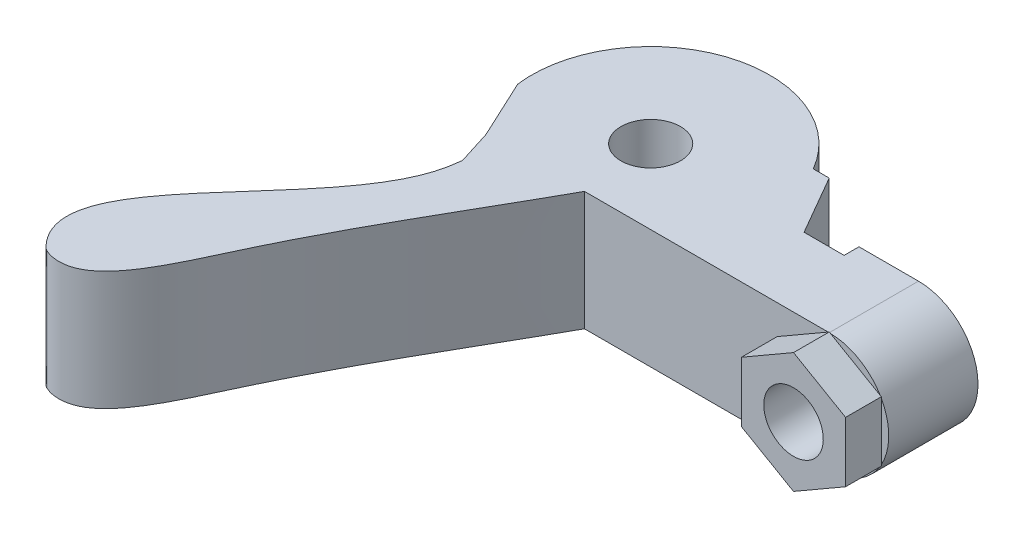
ISO-10303-21;
HEADER;
FILE_DESCRIPTION(('STEP AP214'),'2;1');
FILE_NAME('part.step','',(''),(''),'','','');
FILE_SCHEMA(('AUTOMOTIVE_DESIGN { 1 0 10303 214 1 1 1 1 }'));
ENDSEC;
DATA;
#1=APPLICATION_CONTEXT('core data for automotive mechanical design processes');
#2=APPLICATION_PROTOCOL_DEFINITION('international standard','automotive_design',2000,#1);
#3=PRODUCT_CONTEXT('',#1,'mechanical');
#4=PRODUCT('Part','Part','',(#3));
#5=PRODUCT_RELATED_PRODUCT_CATEGORY('part','',(#4));
#6=PRODUCT_DEFINITION_FORMATION('','',#4);
#7=PRODUCT_DEFINITION_CONTEXT('part definition',#1,'design');
#8=PRODUCT_DEFINITION('design','',#6,#7);
#9=PRODUCT_DEFINITION_SHAPE('','',#8);
#10=(LENGTH_UNIT() NAMED_UNIT(*) SI_UNIT(.MILLI.,.METRE.));
#11=(NAMED_UNIT(*) PLANE_ANGLE_UNIT() SI_UNIT($,.RADIAN.));
#12=(NAMED_UNIT(*) SI_UNIT($,.STERADIAN.) SOLID_ANGLE_UNIT());
#13=UNCERTAINTY_MEASURE_WITH_UNIT(LENGTH_MEASURE(1.E-05),#10,'distance_accuracy_value','');
#14=(GEOMETRIC_REPRESENTATION_CONTEXT(3) GLOBAL_UNCERTAINTY_ASSIGNED_CONTEXT((#13)) GLOBAL_UNIT_ASSIGNED_CONTEXT((#10,
#11,#12)) REPRESENTATION_CONTEXT('',''));
#15=CARTESIAN_POINT('',(0.,0.,0.));
#16=DIRECTION('',(0.,0.,1.));
#17=DIRECTION('',(1.,0.,0.));
#18=AXIS2_PLACEMENT_3D('',#15,#16,#17);
#19=CARTESIAN_POINT('',(20.5,-6.06217782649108,5.));
#20=DIRECTION('',(0.,0.,1.));
#21=DIRECTION('',(0.,1.,0.));
#22=AXIS2_PLACEMENT_3D('',#19,#20,#21);
#23=PLANE('',#22);
#24=CARTESIAN_POINT('',(17.,0.,5.));
#25=DIRECTION('',(0.,0.,1.));
#26=DIRECTION('',(1.,0.,0.));
#27=AXIS2_PLACEMENT_3D('',#24,#25,#26);
#28=CIRCLE('',#27,4.);
#29=CARTESIAN_POINT('',(20.5,-1.9364916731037,5.));
#30=VERTEX_POINT('',#29);
#31=CARTESIAN_POINT('',(20.4270509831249,-2.06284307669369,5.));
#32=VERTEX_POINT('',#31);
#33=EDGE_CURVE('E9',#30,#32,#28,.F.);
#34=ORIENTED_EDGE('',*,*,#33,.F.);
#35=DIRECTION('',(0.,1.,0.));
#36=VECTOR('',#35,1.);
#37=CARTESIAN_POINT('',(20.5,-2.02072594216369,5.));
#38=LINE('',#37,#36);
#39=CARTESIAN_POINT('',(20.5,-2.02072594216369,5.));
#40=VERTEX_POINT('',#39);
#41=EDGE_CURVE('E181',#40,#30,#38,.T.);
#42=ORIENTED_EDGE('',*,*,#41,.F.);
#43=DIRECTION('',(0.866025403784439,0.5,0.));
#44=VECTOR('',#43,1.);
#45=CARTESIAN_POINT('',(17.,-4.04145188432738,5.));
#46=LINE('',#45,#44);
#47=EDGE_CURVE('E175',#32,#40,#46,.T.);
#48=ORIENTED_EDGE('',*,*,#47,.F.);
#49=EDGE_LOOP('',(#34,#42,#48));
#50=FACE_BOUND('',#49,.T.);
#51=ADVANCED_FACE('F14',(#50),#23,.F.);
#52=DIRECTION('',(-1.,0.,0.));
#53=VECTOR('',#52,1.);
#54=CARTESIAN_POINT('',(20.5,-4.,5.));
#55=LINE('',#54,#53);
#56=CARTESIAN_POINT('',(17.,-4.,5.));
#57=VERTEX_POINT('',#56);
#58=CARTESIAN_POINT('',(16.9282032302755,-4.,5.));
#59=VERTEX_POINT('',#58);
#60=EDGE_CURVE('E24',#57,#59,#55,.T.);
#61=ORIENTED_EDGE('',*,*,#60,.F.);
#62=CARTESIAN_POINT('',(17.0729490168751,-3.99933474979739,5.));
#63=VERTEX_POINT('',#62);
#64=EDGE_CURVE('E26',#63,#57,#28,.F.);
#65=ORIENTED_EDGE('',*,*,#64,.F.);
#66=CARTESIAN_POINT('',(17.,-4.04145188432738,5.));
#67=VERTEX_POINT('',#66);
#68=EDGE_CURVE('E176',#67,#63,#46,.T.);
#69=ORIENTED_EDGE('',*,*,#68,.F.);
#70=DIRECTION('',(0.866025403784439,-0.5,0.));
#71=VECTOR('',#70,1.);
#72=CARTESIAN_POINT('',(13.5,-2.02072594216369,5.));
#73=LINE('',#72,#71);
#74=EDGE_CURVE('E166',#59,#67,#73,.T.);
#75=ORIENTED_EDGE('',*,*,#74,.F.);
#76=EDGE_LOOP('',(#61,#65,#69,#75));
#77=FACE_BOUND('',#76,.T.);
#78=ADVANCED_FACE('F344',(#77),#23,.F.);
#79=CARTESIAN_POINT('',(20.4270509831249,2.06284307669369,5.));
#80=VERTEX_POINT('',#79);
#81=CARTESIAN_POINT('',(20.5,1.9364916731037,5.));
#82=VERTEX_POINT('',#81);
#83=EDGE_CURVE('E27',#80,#82,#28,.F.);
#84=ORIENTED_EDGE('',*,*,#83,.F.);
#85=DIRECTION('',(-0.866025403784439,0.5,0.));
#86=VECTOR('',#85,1.);
#87=CARTESIAN_POINT('',(20.5,2.02072594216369,5.));
#88=LINE('',#87,#86);
#89=CARTESIAN_POINT('',(20.5,2.02072594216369,5.));
#90=VERTEX_POINT('',#89);
#91=EDGE_CURVE('E186',#90,#80,#88,.T.);
#92=ORIENTED_EDGE('',*,*,#91,.F.);
#93=EDGE_CURVE('E179',#82,#90,#38,.T.);
#94=ORIENTED_EDGE('',*,*,#93,.F.);
#95=EDGE_LOOP('',(#84,#92,#94));
#96=FACE_BOUND('',#95,.T.);
#97=ADVANCED_FACE('F398',(#96),#23,.F.);
#98=CARTESIAN_POINT('',(13.5,-2.02072594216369,7.4));
#99=DIRECTION('',(0.5,0.866025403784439,0.));
#100=DIRECTION('',(-0.866025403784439,0.5,0.));
#101=AXIS2_PLACEMENT_3D('',#98,#99,#100);
#102=PLANE('',#101);
#103=CARTESIAN_POINT('',(13.5,-2.02072594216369,5.));
#104=VERTEX_POINT('',#103);
#105=EDGE_CURVE('E171',#104,#59,#73,.T.);
#106=ORIENTED_EDGE('',*,*,#105,.T.);
#107=ORIENTED_EDGE('',*,*,#74,.T.);
#108=DIRECTION('',(0.,0.,-1.));
#109=VECTOR('',#108,1.);
#110=CARTESIAN_POINT('',(17.,-4.04145188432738,7.4));
#111=LINE('',#110,#109);
#112=CARTESIAN_POINT('',(17.,-4.04145188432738,7.4));
#113=VERTEX_POINT('',#112);
#114=EDGE_CURVE('E230',#113,#67,#111,.T.);
#115=ORIENTED_EDGE('',*,*,#114,.F.);
#116=DIRECTION('',(0.866025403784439,-0.5,0.));
#117=VECTOR('',#116,1.);
#118=CARTESIAN_POINT('',(13.5,-2.02072594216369,7.4));
#119=LINE('',#118,#117);
#120=CARTESIAN_POINT('',(13.5,-2.02072594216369,7.4));
#121=VERTEX_POINT('',#120);
#122=EDGE_CURVE('E197',#121,#113,#119,.T.);
#123=ORIENTED_EDGE('',*,*,#122,.F.);
#124=DIRECTION('',(0.,0.,-1.));
#125=VECTOR('',#124,1.);
#126=CARTESIAN_POINT('',(13.5,-2.02072594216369,7.4));
#127=LINE('',#126,#125);
#128=EDGE_CURVE('E215',#121,#104,#127,.T.);
#129=ORIENTED_EDGE('',*,*,#128,.T.);
#130=EDGE_LOOP('',(#106,#107,#115,#123,#129));
#131=FACE_BOUND('',#130,.T.);
#132=ADVANCED_FACE('F427',(#131),#102,.F.);
#133=CARTESIAN_POINT('',(17.,-4.04145188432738,7.4));
#134=DIRECTION('',(-0.5,0.866025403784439,0.));
#135=DIRECTION('',(-0.866025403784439,-0.5,0.));
#136=AXIS2_PLACEMENT_3D('',#133,#134,#135);
#137=PLANE('',#136);
#138=ORIENTED_EDGE('',*,*,#68,.T.);
#139=EDGE_CURVE('E180',#63,#32,#46,.T.);
#140=ORIENTED_EDGE('',*,*,#139,.T.);
#141=ORIENTED_EDGE('',*,*,#47,.T.);
#142=DIRECTION('',(0.,0.,-1.));
#143=VECTOR('',#142,1.);
#144=CARTESIAN_POINT('',(20.5,-2.02072594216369,7.4));
#145=LINE('',#144,#143);
#146=CARTESIAN_POINT('',(20.5,-2.02072594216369,7.4));
#147=VERTEX_POINT('',#146);
#148=EDGE_CURVE('E227',#147,#40,#145,.T.);
#149=ORIENTED_EDGE('',*,*,#148,.F.);
#150=DIRECTION('',(0.866025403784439,0.5,0.));
#151=VECTOR('',#150,1.);
#152=CARTESIAN_POINT('',(17.,-4.04145188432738,7.4));
#153=LINE('',#152,#151);
#154=EDGE_CURVE('E200',#113,#147,#153,.T.);
#155=ORIENTED_EDGE('',*,*,#154,.F.);
#156=ORIENTED_EDGE('',*,*,#114,.T.);
#157=EDGE_LOOP('',(#138,#140,#141,#149,#155,#156));
#158=FACE_BOUND('',#157,.T.);
#159=ADVANCED_FACE('F341',(#158),#137,.F.);
#160=CARTESIAN_POINT('',(20.5,-2.02072594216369,7.4));
#161=DIRECTION('',(-1.,0.,0.));
#162=DIRECTION('',(0.,-1.,0.));
#163=AXIS2_PLACEMENT_3D('',#160,#161,#162);
#164=PLANE('',#163);
#165=ORIENTED_EDGE('',*,*,#41,.T.);
#166=EDGE_CURVE('E185',#30,#82,#38,.T.);
#167=ORIENTED_EDGE('',*,*,#166,.T.);
#168=ORIENTED_EDGE('',*,*,#93,.T.);
#169=DIRECTION('',(0.,0.,-1.));
#170=VECTOR('',#169,1.);
#171=CARTESIAN_POINT('',(20.5,2.02072594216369,7.4));
#172=LINE('',#171,#170);
#173=CARTESIAN_POINT('',(20.5,2.02072594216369,7.4));
#174=VERTEX_POINT('',#173);
#175=EDGE_CURVE('E224',#174,#90,#172,.T.);
#176=ORIENTED_EDGE('',*,*,#175,.F.);
#177=DIRECTION('',(0.,1.,0.));
#178=VECTOR('',#177,1.);
#179=CARTESIAN_POINT('',(20.5,-2.02072594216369,7.4));
#180=LINE('',#179,#178);
#181=EDGE_CURVE('E203',#147,#174,#180,.T.);
#182=ORIENTED_EDGE('',*,*,#181,.F.);
#183=ORIENTED_EDGE('',*,*,#148,.T.);
#184=EDGE_LOOP('',(#165,#167,#168,#176,#182,#183));
#185=FACE_BOUND('',#184,.T.);
#186=ADVANCED_FACE('F395',(#185),#164,.F.);
#187=CARTESIAN_POINT('',(20.5,2.02072594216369,7.4));
#188=DIRECTION('',(-0.5,-0.866025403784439,0.));
#189=DIRECTION('',(0.866025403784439,-0.5,0.));
#190=AXIS2_PLACEMENT_3D('',#187,#188,#189);
#191=PLANE('',#190);
#192=ORIENTED_EDGE('',*,*,#91,.T.);
#193=CARTESIAN_POINT('',(17.0729490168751,3.99933474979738,5.));
#194=VERTEX_POINT('',#193);
#195=EDGE_CURVE('E190',#80,#194,#88,.T.);
#196=ORIENTED_EDGE('',*,*,#195,.T.);
#197=CARTESIAN_POINT('',(17.,4.04145188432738,5.));
#198=VERTEX_POINT('',#197);
#199=EDGE_CURVE('E184',#194,#198,#88,.T.);
#200=ORIENTED_EDGE('',*,*,#199,.T.);
#201=DIRECTION('',(0.,0.,-1.));
#202=VECTOR('',#201,1.);
#203=CARTESIAN_POINT('',(17.,4.04145188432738,7.4));
#204=LINE('',#203,#202);
#205=CARTESIAN_POINT('',(17.,4.04145188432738,7.4));
#206=VERTEX_POINT('',#205);
#207=EDGE_CURVE('E221',#206,#198,#204,.T.);
#208=ORIENTED_EDGE('',*,*,#207,.F.);
#209=DIRECTION('',(-0.866025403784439,0.5,0.));
#210=VECTOR('',#209,1.);
#211=CARTESIAN_POINT('',(20.5,2.02072594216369,7.4));
#212=LINE('',#211,#210);
#213=EDGE_CURVE('E206',#174,#206,#212,.T.);
#214=ORIENTED_EDGE('',*,*,#213,.F.);
#215=ORIENTED_EDGE('',*,*,#175,.T.);
#216=EDGE_LOOP('',(#192,#196,#200,#208,#214,#215));
#217=FACE_BOUND('',#216,.T.);
#218=ADVANCED_FACE('F400',(#217),#191,.F.);
#219=CARTESIAN_POINT('',(17.,4.04145188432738,7.4));
#220=DIRECTION('',(0.5,-0.866025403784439,0.));
#221=DIRECTION('',(0.866025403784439,0.5,0.));
#222=AXIS2_PLACEMENT_3D('',#219,#220,#221);
#223=PLANE('',#222);
#224=DIRECTION('',(-0.866025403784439,-0.5,0.));
#225=VECTOR('',#224,1.);
#226=CARTESIAN_POINT('',(17.,4.04145188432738,5.));
#227=LINE('',#226,#225);
#228=CARTESIAN_POINT('',(16.9282032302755,4.,5.));
#229=VERTEX_POINT('',#228);
#230=EDGE_CURVE('E191',#198,#229,#227,.T.);
#231=ORIENTED_EDGE('',*,*,#230,.T.);
#232=CARTESIAN_POINT('',(13.5,2.02072594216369,5.));
#233=VERTEX_POINT('',#232);
#234=EDGE_CURVE('E189',#229,#233,#227,.T.);
#235=ORIENTED_EDGE('',*,*,#234,.T.);
#236=DIRECTION('',(0.,0.,-1.));
#237=VECTOR('',#236,1.);
#238=CARTESIAN_POINT('',(13.5,2.02072594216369,7.4));
#239=LINE('',#238,#237);
#240=CARTESIAN_POINT('',(13.5,2.02072594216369,7.4));
#241=VERTEX_POINT('',#240);
#242=EDGE_CURVE('E218',#241,#233,#239,.T.);
#243=ORIENTED_EDGE('',*,*,#242,.F.);
#244=DIRECTION('',(-0.866025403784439,-0.5,0.));
#245=VECTOR('',#244,1.);
#246=CARTESIAN_POINT('',(17.,4.04145188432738,7.4));
#247=LINE('',#246,#245);
#248=EDGE_CURVE('E209',#206,#241,#247,.T.);
#249=ORIENTED_EDGE('',*,*,#248,.F.);
#250=ORIENTED_EDGE('',*,*,#207,.T.);
#251=EDGE_LOOP('',(#231,#235,#243,#249,#250));
#252=FACE_BOUND('',#251,.T.);
#253=ADVANCED_FACE('F526',(#252),#223,.F.);
#254=CARTESIAN_POINT('',(13.5,2.02072594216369,7.4));
#255=DIRECTION('',(1.,0.,0.));
#256=DIRECTION('',(0.,1.,0.));
#257=AXIS2_PLACEMENT_3D('',#254,#255,#256);
#258=PLANE('',#257);
#259=DIRECTION('',(0.,-1.,0.));
#260=VECTOR('',#259,1.);
#261=CARTESIAN_POINT('',(13.5,2.02072594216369,5.));
#262=LINE('',#261,#260);
#263=EDGE_CURVE('E194',#233,#104,#262,.T.);
#264=ORIENTED_EDGE('',*,*,#263,.T.);
#265=ORIENTED_EDGE('',*,*,#128,.F.);
#266=DIRECTION('',(0.,-1.,0.));
#267=VECTOR('',#266,1.);
#268=CARTESIAN_POINT('',(13.5,2.02072594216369,7.4));
#269=LINE('',#268,#267);
#270=EDGE_CURVE('E212',#241,#121,#269,.T.);
#271=ORIENTED_EDGE('',*,*,#270,.F.);
#272=ORIENTED_EDGE('',*,*,#242,.T.);
#273=EDGE_LOOP('',(#264,#265,#271,#272));
#274=FACE_BOUND('',#273,.T.);
#275=ADVANCED_FACE('F531',(#274),#258,.F.);
#276=CARTESIAN_POINT('',(20.5,-6.06217782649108,7.4));
#277=DIRECTION('',(0.,0.,1.));
#278=DIRECTION('',(0.,1.,0.));
#279=AXIS2_PLACEMENT_3D('',#276,#277,#278);
#280=PLANE('',#279);
#281=CARTESIAN_POINT('',(17.,0.,7.4));
#282=DIRECTION('',(0.,0.,1.));
#283=DIRECTION('',(0.,1.,0.));
#284=AXIS2_PLACEMENT_3D('',#281,#282,#283);
#285=CIRCLE('',#284,2.);
#286=CARTESIAN_POINT('',(17.,1.99999999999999,7.4));
#287=VERTEX_POINT('',#286);
#288=EDGE_CURVE('E161',#287,#287,#285,.T.);
#289=ORIENTED_EDGE('',*,*,#288,.F.);
#290=EDGE_LOOP('',(#289));
#291=FACE_BOUND('',#290,.T.);
#292=ORIENTED_EDGE('',*,*,#122,.T.);
#293=ORIENTED_EDGE('',*,*,#154,.T.);
#294=ORIENTED_EDGE('',*,*,#181,.T.);
#295=ORIENTED_EDGE('',*,*,#213,.T.);
#296=ORIENTED_EDGE('',*,*,#248,.T.);
#297=ORIENTED_EDGE('',*,*,#270,.T.);
#298=EDGE_LOOP('',(#292,#293,#294,#295,#296,#297));
#299=FACE_BOUND('',#298,.T.);
#300=ADVANCED_FACE('F406',(#291,#299),#280,.T.);
#301=CARTESIAN_POINT('',(17.,4.,5.));
#302=VERTEX_POINT('',#301);
#303=EDGE_CURVE('E234',#302,#194,#28,.F.);
#304=ORIENTED_EDGE('',*,*,#303,.F.);
#305=DIRECTION('',(-1.,0.,0.));
#306=VECTOR('',#305,1.);
#307=CARTESIAN_POINT('',(20.5,4.,5.));
#308=LINE('',#307,#306);
#309=EDGE_CURVE('E235',#302,#229,#308,.T.);
#310=ORIENTED_EDGE('',*,*,#309,.T.);
#311=ORIENTED_EDGE('',*,*,#230,.F.);
#312=ORIENTED_EDGE('',*,*,#199,.F.);
#313=EDGE_LOOP('',(#304,#310,#311,#312));
#314=FACE_BOUND('',#313,.T.);
#315=ADVANCED_FACE('F411',(#314),#23,.F.);
#316=CARTESIAN_POINT('',(17.,0.,7.4));
#317=DIRECTION('',(0.,0.,1.));
#318=DIRECTION('',(0.,1.,0.));
#319=AXIS2_PLACEMENT_3D('',#316,#317,#318);
#320=CYLINDRICAL_SURFACE('',#319,2.);
#321=ORIENTED_EDGE('',*,*,#288,.T.);
#322=EDGE_LOOP('',(#321));
#323=FACE_BOUND('',#322,.T.);
#324=CARTESIAN_POINT('',(17.,0.,-1.));
#325=DIRECTION('',(0.,0.,1.));
#326=DIRECTION('',(1.,0.,0.));
#327=AXIS2_PLACEMENT_3D('',#324,#325,#326);
#328=CIRCLE('',#327,2.);
#329=CARTESIAN_POINT('',(19.,0.,-1.));
#330=VERTEX_POINT('',#329);
#331=EDGE_CURVE('E18',#330,#330,#328,.T.);
#332=ORIENTED_EDGE('',*,*,#331,.F.);
#333=EDGE_LOOP('',(#332));
#334=FACE_BOUND('',#333,.T.);
#335=ADVANCED_FACE('F293',(#323,#334),#320,.F.);
#336=CARTESIAN_POINT('',(13.,4.,0.));
#337=DIRECTION('',(1.,0.,0.));
#338=DIRECTION('',(0.,1.,0.));
#339=AXIS2_PLACEMENT_3D('',#336,#337,#338);
#340=PLANE('',#339);
#341=DIRECTION('',(0.,0.,1.));
#342=VECTOR('',#341,1.);
#343=CARTESIAN_POINT('',(13.,-4.,0.));
#344=LINE('',#343,#342);
#345=CARTESIAN_POINT('',(13.,-4.,-1.));
#346=VERTEX_POINT('',#345);
#347=CARTESIAN_POINT('',(13.,-4.,0.));
#348=VERTEX_POINT('',#347);
#349=EDGE_CURVE('E498',#346,#348,#344,.T.);
#350=ORIENTED_EDGE('',*,*,#349,.T.);
#351=DIRECTION('',(0.,-1.,0.));
#352=VECTOR('',#351,1.);
#353=CARTESIAN_POINT('',(13.,4.,0.));
#354=LINE('',#353,#352);
#355=CARTESIAN_POINT('',(13.,4.,0.));
#356=VERTEX_POINT('',#355);
#357=EDGE_CURVE('E155',#356,#348,#354,.T.);
#358=ORIENTED_EDGE('',*,*,#357,.F.);
#359=DIRECTION('',(0.,0.,1.));
#360=VECTOR('',#359,1.);
#361=CARTESIAN_POINT('',(13.,4.,0.));
#362=LINE('',#361,#360);
#363=CARTESIAN_POINT('',(13.,4.,-1.));
#364=VERTEX_POINT('',#363);
#365=EDGE_CURVE('E483',#364,#356,#362,.T.);
#366=ORIENTED_EDGE('',*,*,#365,.F.);
#367=DIRECTION('',(0.,-1.,0.));
#368=VECTOR('',#367,1.);
#369=CARTESIAN_POINT('',(13.,4.,-1.));
#370=LINE('',#369,#368);
#371=EDGE_CURVE('E158',#364,#346,#370,.T.);
#372=ORIENTED_EDGE('',*,*,#371,.T.);
#373=EDGE_LOOP('',(#350,#358,#366,#372));
#374=FACE_BOUND('',#373,.T.);
#375=ADVANCED_FACE('F290',(#374),#340,.F.);
#376=CARTESIAN_POINT('',(10.3094010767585,4.,0.));
#377=DIRECTION('',(0.,0.,1.));
#378=DIRECTION('',(1.,0.,0.));
#379=AXIS2_PLACEMENT_3D('',#376,#377,#378);
#380=PLANE('',#379);
#381=DIRECTION('',(-1.,0.,0.));
#382=VECTOR('',#381,1.);
#383=CARTESIAN_POINT('',(10.3094010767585,-4.,0.));
#384=LINE('',#383,#382);
#385=CARTESIAN_POINT('',(10.3094010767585,-4.,0.));
#386=VERTEX_POINT('',#385);
#387=EDGE_CURVE('E500',#348,#386,#384,.T.);
#388=ORIENTED_EDGE('',*,*,#387,.T.);
#389=DIRECTION('',(0.,-1.,0.));
#390=VECTOR('',#389,1.);
#391=CARTESIAN_POINT('',(10.3094010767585,4.,0.));
#392=LINE('',#391,#390);
#393=CARTESIAN_POINT('',(10.3094010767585,4.,0.));
#394=VERTEX_POINT('',#393);
#395=EDGE_CURVE('E152',#394,#386,#392,.T.);
#396=ORIENTED_EDGE('',*,*,#395,.F.);
#397=DIRECTION('',(-1.,0.,0.));
#398=VECTOR('',#397,1.);
#399=CARTESIAN_POINT('',(10.3094010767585,4.,0.));
#400=LINE('',#399,#398);
#401=EDGE_CURVE('E485',#356,#394,#400,.T.);
#402=ORIENTED_EDGE('',*,*,#401,.F.);
#403=ORIENTED_EDGE('',*,*,#357,.T.);
#404=EDGE_LOOP('',(#388,#396,#402,#403));
#405=FACE_BOUND('',#404,.T.);
#406=ADVANCED_FACE('F286',(#405),#380,.F.);
#407=CARTESIAN_POINT('',(8.,4.,-4.));
#408=DIRECTION('',(-0.866025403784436,0.,0.5));
#409=DIRECTION('',(0.5,0.,0.866025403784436));
#410=AXIS2_PLACEMENT_3D('',#407,#408,#409);
#411=PLANE('',#410);
#412=DIRECTION('',(-0.5,0.,-0.866025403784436));
#413=VECTOR('',#412,1.);
#414=CARTESIAN_POINT('',(8.,-4.,-4.));
#415=LINE('',#414,#413);
#416=CARTESIAN_POINT('',(8.,-4.,-4.));
#417=VERTEX_POINT('',#416);
#418=EDGE_CURVE('E502',#386,#417,#415,.T.);
#419=ORIENTED_EDGE('',*,*,#418,.T.);
#420=DIRECTION('',(0.,-1.,0.));
#421=VECTOR('',#420,1.);
#422=CARTESIAN_POINT('',(8.,4.,-4.));
#423=LINE('',#422,#421);
#424=CARTESIAN_POINT('',(8.,4.,-4.));
#425=VERTEX_POINT('',#424);
#426=EDGE_CURVE('E150',#425,#417,#423,.T.);
#427=ORIENTED_EDGE('',*,*,#426,.F.);
#428=DIRECTION('',(-0.5,0.,-0.866025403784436));
#429=VECTOR('',#428,1.);
#430=CARTESIAN_POINT('',(8.,4.,-4.));
#431=LINE('',#430,#429);
#432=EDGE_CURVE('E487',#394,#425,#431,.T.);
#433=ORIENTED_EDGE('',*,*,#432,.F.);
#434=ORIENTED_EDGE('',*,*,#395,.T.);
#435=EDGE_LOOP('',(#419,#427,#433,#434));
#436=FACE_BOUND('',#435,.T.);
#437=ADVANCED_FACE('F283',(#436),#411,.F.);
#438=CARTESIAN_POINT('',(8.,4.,-4.));
#439=DIRECTION('',(0.,0.,1.));
#440=DIRECTION('',(0.,1.,0.));
#441=AXIS2_PLACEMENT_3D('',#438,#439,#440);
#442=PLANE('',#441);
#443=DIRECTION('',(-1.,0.,0.));
#444=VECTOR('',#443,1.);
#445=CARTESIAN_POINT('',(8.,-4.,-4.));
#446=LINE('',#445,#444);
#447=CARTESIAN_POINT('',(6.92820323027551,-4.,-4.));
#448=VERTEX_POINT('',#447);
#449=EDGE_CURVE('E113',#417,#448,#446,.T.);
#450=ORIENTED_EDGE('',*,*,#449,.T.);
#451=DIRECTION('',(0.,-1.,0.));
#452=VECTOR('',#451,1.);
#453=CARTESIAN_POINT('',(6.92820323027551,4.,-4.));
#454=LINE('',#453,#452);
#455=CARTESIAN_POINT('',(6.92820323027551,4.,-4.));
#456=VERTEX_POINT('',#455);
#457=EDGE_CURVE('E125',#456,#448,#454,.T.);
#458=ORIENTED_EDGE('',*,*,#457,.F.);
#459=DIRECTION('',(-1.,0.,0.));
#460=VECTOR('',#459,1.);
#461=CARTESIAN_POINT('',(8.,4.,-4.));
#462=LINE('',#461,#460);
#463=EDGE_CURVE('E489',#425,#456,#462,.T.);
#464=ORIENTED_EDGE('',*,*,#463,.F.);
#465=ORIENTED_EDGE('',*,*,#426,.T.);
#466=EDGE_LOOP('',(#450,#458,#464,#465));
#467=FACE_BOUND('',#466,.T.);
#468=ADVANCED_FACE('F280',(#467),#442,.F.);
#469=CARTESIAN_POINT('',(0.,4.,0.));
#470=DIRECTION('',(0.,-1.,0.));
#471=DIRECTION('',(1.,0.,0.));
#472=AXIS2_PLACEMENT_3D('',#469,#470,#471);
#473=CYLINDRICAL_SURFACE('',#472,8.);
#474=CARTESIAN_POINT('',(0.,-4.,0.));
#475=DIRECTION('',(0.,1.,0.));
#476=DIRECTION('',(-1.,0.,0.));
#477=AXIS2_PLACEMENT_3D('',#474,#475,#476);
#478=CIRCLE('',#477,8.);
#479=CARTESIAN_POINT('',(-7.93725393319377,-4.,1.));
#480=VERTEX_POINT('',#479);
#481=EDGE_CURVE('E119',#448,#480,#478,.T.);
#482=ORIENTED_EDGE('',*,*,#481,.T.);
#483=DIRECTION('',(0.,-1.,0.));
#484=VECTOR('',#483,1.);
#485=CARTESIAN_POINT('',(-7.93725393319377,4.,1.));
#486=LINE('',#485,#484);
#487=CARTESIAN_POINT('',(-7.93725393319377,4.,1.));
#488=VERTEX_POINT('',#487);
#489=EDGE_CURVE('E123',#488,#480,#486,.T.);
#490=ORIENTED_EDGE('',*,*,#489,.F.);
#491=CARTESIAN_POINT('',(0.,4.,0.));
#492=DIRECTION('',(0.,1.,0.));
#493=DIRECTION('',(-1.,0.,0.));
#494=AXIS2_PLACEMENT_3D('',#491,#492,#493);
#495=CIRCLE('',#494,8.);
#496=EDGE_CURVE('E491',#456,#488,#495,.T.);
#497=ORIENTED_EDGE('',*,*,#496,.F.);
#498=ORIENTED_EDGE('',*,*,#457,.T.);
#499=EDGE_LOOP('',(#482,#490,#497,#498));
#500=FACE_BOUND('',#499,.T.);
#501=ADVANCED_FACE('F121',(#500),#473,.T.);
#502=CARTESIAN_POINT('',(-6.34179883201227,4.,4.42146450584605));
#503=DIRECTION('',(0.906307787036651,0.,-0.422618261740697));
#504=DIRECTION('',(-0.422618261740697,0.,-0.906307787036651));
#505=AXIS2_PLACEMENT_3D('',#502,#503,#504);
#506=PLANE('',#505);
#507=DIRECTION('',(0.422618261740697,0.,0.906307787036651));
#508=VECTOR('',#507,1.);
#509=CARTESIAN_POINT('',(-6.34179883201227,-4.,4.42146450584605));
#510=LINE('',#509,#508);
#511=CARTESIAN_POINT('',(-6.07202330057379,-4.,5.));
#512=VERTEX_POINT('',#511);
#513=EDGE_CURVE('E128',#480,#512,#510,.T.);
#514=ORIENTED_EDGE('',*,*,#513,.T.);
#515=DIRECTION('',(0.,1.,0.));
#516=VECTOR('',#515,1.);
#517=CARTESIAN_POINT('',(-6.07202330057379,-5.15707098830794,5.));
#518=LINE('',#517,#516);
#519=CARTESIAN_POINT('',(-6.07202330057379,4.,5.));
#520=VERTEX_POINT('',#519);
#521=EDGE_CURVE('E469',#512,#520,#518,.T.);
#522=ORIENTED_EDGE('',*,*,#521,.T.);
#523=DIRECTION('',(0.422618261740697,0.,0.906307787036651));
#524=VECTOR('',#523,1.);
#525=CARTESIAN_POINT('',(-6.34179883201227,4.,4.42146450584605));
#526=LINE('',#525,#524);
#527=EDGE_CURVE('E135',#488,#520,#526,.T.);
#528=ORIENTED_EDGE('',*,*,#527,.F.);
#529=ORIENTED_EDGE('',*,*,#489,.T.);
#530=EDGE_LOOP('',(#514,#522,#528,#529));
#531=FACE_BOUND('',#530,.T.);
#532=ADVANCED_FACE('F132',(#531),#506,.F.);
#533=CARTESIAN_POINT('',(-5.34754733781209,4.,7.3048969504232));
#534=DIRECTION('',(0.953984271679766,0.,-0.299856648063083));
#535=DIRECTION('',(-0.299856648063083,0.,-0.953984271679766));
#536=AXIS2_PLACEMENT_3D('',#533,#534,#535);
#537=PLANE('',#536);
#538=DIRECTION('',(0.299856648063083,0.,0.953984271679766));
#539=VECTOR('',#538,1.);
#540=CARTESIAN_POINT('',(-5.34754733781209,-4.,7.3048969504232));
#541=LINE('',#540,#539);
#542=CARTESIAN_POINT('',(-5.34754733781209,-4.,7.3048969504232));
#543=VERTEX_POINT('',#542);
#544=EDGE_CURVE('E141',#512,#543,#541,.T.);
#545=ORIENTED_EDGE('',*,*,#544,.T.);
#546=DIRECTION('',(0.,-1.,0.));
#547=VECTOR('',#546,1.);
#548=CARTESIAN_POINT('',(-5.34754733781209,4.,7.3048969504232));
#549=LINE('',#548,#547);
#550=CARTESIAN_POINT('',(-5.34754733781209,4.,7.3048969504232));
#551=VERTEX_POINT('',#550);
#552=EDGE_CURVE('E439',#551,#543,#549,.T.);
#553=ORIENTED_EDGE('',*,*,#552,.F.);
#554=DIRECTION('',(0.299856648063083,0.,0.953984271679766));
#555=VECTOR('',#554,1.);
#556=CARTESIAN_POINT('',(-5.34754733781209,4.,7.3048969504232));
#557=LINE('',#556,#555);
#558=EDGE_CURVE('E434',#520,#551,#557,.T.);
#559=ORIENTED_EDGE('',*,*,#558,.F.);
#560=ORIENTED_EDGE('',*,*,#521,.F.);
#561=EDGE_LOOP('',(#545,#553,#559,#560));
#562=FACE_BOUND('',#561,.T.);
#563=ADVANCED_FACE('F256',(#562),#537,.F.);
#564=CARTESIAN_POINT('',(-5.34754733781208,4.,7.3048969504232));
#565=CARTESIAN_POINT('',(-5.35535935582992,4.,7.3637034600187));
#566=CARTESIAN_POINT('',(-5.37097364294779,4.,7.48124309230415));
#567=CARTESIAN_POINT('',(-5.39523817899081,4.,7.6571131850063));
#568=CARTESIAN_POINT('',(-5.43279972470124,4.,7.91050725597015));
#569=CARTESIAN_POINT('',(-5.49592509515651,4.,8.27442352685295));
#570=CARTESIAN_POINT('',(-5.60142040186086,4.,8.7029280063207));
#571=CARTESIAN_POINT('',(-5.74247002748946,4.,9.15158947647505));
#572=CARTESIAN_POINT('',(-5.89385709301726,4.,9.55332748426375));
#573=CARTESIAN_POINT('',(-6.07750259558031,4.,9.97698137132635));
#574=CARTESIAN_POINT('',(-6.26309633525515,4.,10.3586849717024));
#575=CARTESIAN_POINT('',(-6.46937748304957,4.,10.7449727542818));
#576=CARTESIAN_POINT('',(-6.66184808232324,4.,11.0794912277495));
#577=CARTESIAN_POINT('',(-6.87062377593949,4.,11.4211678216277));
#578=CARTESIAN_POINT('',(-7.07103381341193,4.,11.732107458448));
#579=CARTESIAN_POINT('',(-7.2955493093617,4.,12.0646569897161));
#580=CARTESIAN_POINT('',(-7.50903893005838,4.,12.3680137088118));
#581=CARTESIAN_POINT('',(-7.74632096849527,4.,12.6931684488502));
#582=CARTESIAN_POINT('',(-7.97039748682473,4.,12.9903933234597));
#583=CARTESIAN_POINT('',(-8.21796899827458,4.,13.3095925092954));
#584=CARTESIAN_POINT('',(-8.45052220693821,4.,13.6019110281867));
#585=CARTESIAN_POINT('',(-8.70625305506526,4.,13.9163899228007));
#586=CARTESIAN_POINT('',(-8.94543944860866,4.,14.2048707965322));
#587=CARTESIAN_POINT('',(-9.22152239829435,4.,14.5324328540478));
#588=CARTESIAN_POINT('',(-9.49126012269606,4.,14.8475875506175));
#589=CARTESIAN_POINT('',(-9.79815343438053,4.,15.201619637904));
#590=CARTESIAN_POINT('',(-10.0833347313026,4.,15.5273222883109));
#591=CARTESIAN_POINT('',(-10.384850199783,4.,15.8693911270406));
#592=CARTESIAN_POINT('',(-10.6562839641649,4.,16.1761401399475));
#593=CARTESIAN_POINT('',(-10.9430029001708,4.,16.4998715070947));
#594=CARTESIAN_POINT('',(-11.2074273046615,4.,16.7988380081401));
#595=CARTESIAN_POINT('',(-11.4930641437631,4.,17.1231930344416));
#596=CARTESIAN_POINT('',(-11.7555456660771,4.,17.4232811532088));
#597=CARTESIAN_POINT('',(-12.0380022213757,4.,17.7494727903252));
#598=CARTESIAN_POINT('',(-12.2965075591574,4.,18.0518587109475));
#599=CARTESIAN_POINT('',(-12.5734421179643,4.,18.3812417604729));
#600=CARTESIAN_POINT('',(-12.8256538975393,4.,18.6872676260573));
#601=CARTESIAN_POINT('',(-13.0943390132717,4.,19.02142236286));
#602=CARTESIAN_POINT('',(-13.3374992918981,4.,19.3326888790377));
#603=CARTESIAN_POINT('',(-13.5946144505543,4.,19.6735439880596));
#604=CARTESIAN_POINT('',(-13.8252883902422,4.,19.9920518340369));
#605=CARTESIAN_POINT('',(-14.0665953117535,4.,20.3420792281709));
#606=CARTESIAN_POINT('',(-14.2802881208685,4.,20.6704622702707));
#607=CARTESIAN_POINT('',(-14.5060115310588,4.,21.0427906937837));
#608=CARTESIAN_POINT('',(-14.705908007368,4.,21.4029317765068));
#609=CARTESIAN_POINT('',(-14.9081538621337,4.,21.812745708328));
#610=CARTESIAN_POINT('',(-15.0740917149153,4.,22.2034086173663));
#611=CARTESIAN_POINT('',(-15.2241972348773,4.,22.6397576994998));
#612=CARTESIAN_POINT('',(-15.3304397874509,4.,23.0583557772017));
#613=CARTESIAN_POINT('',(-15.4007710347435,4.,23.5355239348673));
#614=CARTESIAN_POINT('',(-15.4119212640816,4.,24.0099986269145));
#615=CARTESIAN_POINT('',(-15.3379811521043,4.,24.5807449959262));
#616=CARTESIAN_POINT('',(-15.1378735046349,4.,25.1970279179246));
#617=CARTESIAN_POINT('',(-14.8120232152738,4.,25.750863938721));
#618=CARTESIAN_POINT('',(-14.5114217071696,4.,26.1160354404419));
#619=CARTESIAN_POINT('',(-14.3317367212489,4.,26.3206105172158));
#620=CARTESIAN_POINT('',(-14.2175998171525,4.,26.4166054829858));
#621=CARTESIAN_POINT('',(-14.1621687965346,4.,26.4632258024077));
#622=B_SPLINE_CURVE_WITH_KNOTS('',3,(#564,#565,#566,#567,#568,#569,#570,#571,#572,#573,#574,
#575,#576,#577,#578,#579,#580,#581,#582,#583,#584,#585,#586,#587,#588,#589,#590,#591,#592,#593,
#594,#595,#596,#597,#598,#599,#600,#601,#602,#603,#604,#605,#606,#607,#608,#609,#610,#611,#612,
#613,#614,#615,#616,#617,#618,#619,#620,#621),.UNSPECIFIED.,.F.,.F.,(4,1,1,1,1,1,1,1,1,1,1,1,1,
1,1,1,1,1,1,1,1,1,1,1,1,1,1,1,1,1,1,1,1,1,1,1,1,1,1,1,1,1,1,1,1,1,1,1,1,1,1,1,1,1,1,4),(0.,
0.00782753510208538,0.015645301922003,0.0234441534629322,0.0417089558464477,0.0646662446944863,
0.0825304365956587,0.105122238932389,0.122800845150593,0.145247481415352,0.162863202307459,
0.182433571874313,0.197812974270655,0.217396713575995,0.2327954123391,0.252411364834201,
0.267839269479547,0.287495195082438,0.302955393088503,0.322652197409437,0.338143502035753,
0.357877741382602,0.373396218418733,0.396118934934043,0.413985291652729,0.436736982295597,
0.454620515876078,0.475588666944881,0.492064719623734,0.513032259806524,0.529502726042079,
0.550456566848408,0.566911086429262,0.587838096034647,0.604266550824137,0.625154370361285,
0.641547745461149,0.66238630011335,0.678738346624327,0.699522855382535,0.715833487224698,
0.73657076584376,0.752853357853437,0.77513339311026,0.792659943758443,0.815039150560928,
0.83273913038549,0.855011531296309,0.872880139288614,0.896472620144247,0.916226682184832,
0.944523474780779,0.972484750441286,0.985741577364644,0.993075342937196,1.),.UNSPECIFIED.);
#623=DIRECTION('',(0.,-1.,0.));
#624=VECTOR('',#623,1.);
#625=SURFACE_OF_LINEAR_EXTRUSION('',#622,#624);
#626=CARTESIAN_POINT('',(-5.34754733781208,-4.,7.3048969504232));
#627=CARTESIAN_POINT('',(-5.35535935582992,-4.,7.3637034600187));
#628=CARTESIAN_POINT('',(-5.37097364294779,-4.,7.48124309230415));
#629=CARTESIAN_POINT('',(-5.39523817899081,-4.,7.6571131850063));
#630=CARTESIAN_POINT('',(-5.43279972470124,-4.,7.91050725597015));
#631=CARTESIAN_POINT('',(-5.49592509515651,-4.,8.27442352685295));
#632=CARTESIAN_POINT('',(-5.60142040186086,-4.,8.7029280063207));
#633=CARTESIAN_POINT('',(-5.74247002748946,-4.,9.15158947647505));
#634=CARTESIAN_POINT('',(-5.89385709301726,-4.,9.55332748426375));
#635=CARTESIAN_POINT('',(-6.07750259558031,-4.,9.97698137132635));
#636=CARTESIAN_POINT('',(-6.26309633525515,-4.,10.3586849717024));
#637=CARTESIAN_POINT('',(-6.46937748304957,-4.,10.7449727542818));
#638=CARTESIAN_POINT('',(-6.66184808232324,-4.,11.0794912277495));
#639=CARTESIAN_POINT('',(-6.87062377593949,-4.,11.4211678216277));
#640=CARTESIAN_POINT('',(-7.07103381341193,-4.,11.732107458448));
#641=CARTESIAN_POINT('',(-7.2955493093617,-4.,12.0646569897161));
#642=CARTESIAN_POINT('',(-7.50903893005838,-4.,12.3680137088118));
#643=CARTESIAN_POINT('',(-7.74632096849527,-4.,12.6931684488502));
#644=CARTESIAN_POINT('',(-7.97039748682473,-4.,12.9903933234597));
#645=CARTESIAN_POINT('',(-8.21796899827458,-4.,13.3095925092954));
#646=CARTESIAN_POINT('',(-8.45052220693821,-4.,13.6019110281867));
#647=CARTESIAN_POINT('',(-8.70625305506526,-4.,13.9163899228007));
#648=CARTESIAN_POINT('',(-8.94543944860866,-4.,14.2048707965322));
#649=CARTESIAN_POINT('',(-9.22152239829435,-4.,14.5324328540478));
#650=CARTESIAN_POINT('',(-9.49126012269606,-4.,14.8475875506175));
#651=CARTESIAN_POINT('',(-9.79815343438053,-4.,15.201619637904));
#652=CARTESIAN_POINT('',(-10.0833347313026,-4.,15.5273222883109));
#653=CARTESIAN_POINT('',(-10.384850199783,-4.,15.8693911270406));
#654=CARTESIAN_POINT('',(-10.6562839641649,-4.,16.1761401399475));
#655=CARTESIAN_POINT('',(-10.9430029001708,-4.,16.4998715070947));
#656=CARTESIAN_POINT('',(-11.2074273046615,-4.,16.7988380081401));
#657=CARTESIAN_POINT('',(-11.4930641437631,-4.,17.1231930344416));
#658=CARTESIAN_POINT('',(-11.7555456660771,-4.,17.4232811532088));
#659=CARTESIAN_POINT('',(-12.0380022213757,-4.,17.7494727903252));
#660=CARTESIAN_POINT('',(-12.2965075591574,-4.,18.0518587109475));
#661=CARTESIAN_POINT('',(-12.5734421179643,-4.,18.3812417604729));
#662=CARTESIAN_POINT('',(-12.8256538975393,-4.,18.6872676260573));
#663=CARTESIAN_POINT('',(-13.0943390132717,-4.,19.02142236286));
#664=CARTESIAN_POINT('',(-13.3374992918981,-4.,19.3326888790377));
#665=CARTESIAN_POINT('',(-13.5946144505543,-4.,19.6735439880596));
#666=CARTESIAN_POINT('',(-13.8252883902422,-4.,19.9920518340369));
#667=CARTESIAN_POINT('',(-14.0665953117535,-4.,20.3420792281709));
#668=CARTESIAN_POINT('',(-14.2802881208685,-4.,20.6704622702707));
#669=CARTESIAN_POINT('',(-14.5060115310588,-4.,21.0427906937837));
#670=CARTESIAN_POINT('',(-14.705908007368,-4.,21.4029317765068));
#671=CARTESIAN_POINT('',(-14.9081538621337,-4.,21.812745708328));
#672=CARTESIAN_POINT('',(-15.0740917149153,-4.,22.2034086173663));
#673=CARTESIAN_POINT('',(-15.2241972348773,-4.,22.6397576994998));
#674=CARTESIAN_POINT('',(-15.3304397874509,-4.,23.0583557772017));
#675=CARTESIAN_POINT('',(-15.4007710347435,-4.,23.5355239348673));
#676=CARTESIAN_POINT('',(-15.4119212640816,-4.,24.0099986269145));
#677=CARTESIAN_POINT('',(-15.3379811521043,-4.,24.5807449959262));
#678=CARTESIAN_POINT('',(-15.1378735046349,-4.,25.1970279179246));
#679=CARTESIAN_POINT('',(-14.8120232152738,-4.,25.750863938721));
#680=CARTESIAN_POINT('',(-14.5114217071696,-4.,26.1160354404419));
#681=CARTESIAN_POINT('',(-14.3317367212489,-4.,26.3206105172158));
#682=CARTESIAN_POINT('',(-14.2175998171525,-4.,26.4166054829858));
#683=CARTESIAN_POINT('',(-14.1621687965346,-4.,26.4632258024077));
#684=B_SPLINE_CURVE_WITH_KNOTS('',3,(#626,#627,#628,#629,#630,#631,#632,#633,#634,#635,#636,
#637,#638,#639,#640,#641,#642,#643,#644,#645,#646,#647,#648,#649,#650,#651,#652,#653,#654,#655,
#656,#657,#658,#659,#660,#661,#662,#663,#664,#665,#666,#667,#668,#669,#670,#671,#672,#673,#674,
#675,#676,#677,#678,#679,#680,#681,#682,#683),.UNSPECIFIED.,.F.,.F.,(4,1,1,1,1,1,1,1,1,1,1,1,1,
1,1,1,1,1,1,1,1,1,1,1,1,1,1,1,1,1,1,1,1,1,1,1,1,1,1,1,1,1,1,1,1,1,1,1,1,1,1,1,1,1,1,4),(0.,
0.00782753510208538,0.015645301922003,0.0234441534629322,0.0417089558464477,0.0646662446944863,
0.0825304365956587,0.105122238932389,0.122800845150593,0.145247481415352,0.162863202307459,
0.182433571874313,0.197812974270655,0.217396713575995,0.2327954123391,0.252411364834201,
0.267839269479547,0.287495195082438,0.302955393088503,0.322652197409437,0.338143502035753,
0.357877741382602,0.373396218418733,0.396118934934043,0.413985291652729,0.436736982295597,
0.454620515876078,0.475588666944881,0.492064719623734,0.513032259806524,0.529502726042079,
0.550456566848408,0.566911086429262,0.587838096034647,0.604266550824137,0.625154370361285,
0.641547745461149,0.66238630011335,0.678738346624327,0.699522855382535,0.715833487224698,
0.73657076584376,0.752853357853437,0.77513339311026,0.792659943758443,0.815039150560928,
0.83273913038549,0.855011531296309,0.872880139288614,0.896472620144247,0.916226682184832,
0.944523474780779,0.972484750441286,0.985741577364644,0.993075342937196,1.),.UNSPECIFIED.);
#685=CARTESIAN_POINT('',(-14.1621687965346,-4.,26.4632258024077));
#686=VERTEX_POINT('',#685);
#687=EDGE_CURVE('E440',#543,#686,#684,.T.);
#688=ORIENTED_EDGE('',*,*,#687,.T.);
#689=DIRECTION('',(0.,-1.,0.));
#690=VECTOR('',#689,1.);
#691=CARTESIAN_POINT('',(-14.1621687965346,4.,26.4632258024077));
#692=LINE('',#691,#690);
#693=CARTESIAN_POINT('',(-14.1621687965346,4.,26.4632258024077));
#694=VERTEX_POINT('',#693);
#695=EDGE_CURVE('E466',#694,#686,#692,.T.);
#696=ORIENTED_EDGE('',*,*,#695,.F.);
#697=EDGE_CURVE('E239',#551,#694,#622,.T.);
#698=ORIENTED_EDGE('',*,*,#697,.F.);
#699=ORIENTED_EDGE('',*,*,#552,.T.);
#700=EDGE_LOOP('',(#688,#696,#698,#699));
#701=FACE_BOUND('',#700,.T.);
#702=ADVANCED_FACE('F251',(#701),#625,.F.);
#703=CARTESIAN_POINT('',(-14.1334297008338,4.,26.4798183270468));
#704=DIRECTION('',(0.500000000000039,0.,-0.866025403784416));
#705=DIRECTION('',(-0.866025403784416,0.,-0.500000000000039));
#706=AXIS2_PLACEMENT_3D('',#703,#704,#705);
#707=PLANE('',#706);
#708=DIRECTION('',(0.866025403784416,0.,0.500000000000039));
#709=VECTOR('',#708,1.);
#710=CARTESIAN_POINT('',(-14.1334297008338,-4.,26.4798183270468));
#711=LINE('',#710,#709);
#712=CARTESIAN_POINT('',(-14.0797446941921,-4.,26.5108133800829));
#713=VERTEX_POINT('',#712);
#714=EDGE_CURVE('E445',#686,#713,#711,.T.);
#715=ORIENTED_EDGE('',*,*,#714,.T.);
#716=DIRECTION('',(0.,-1.,0.));
#717=VECTOR('',#716,1.);
#718=CARTESIAN_POINT('',(-14.0797446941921,4.,26.5108133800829));
#719=LINE('',#718,#717);
#720=CARTESIAN_POINT('',(-14.0797446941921,4.,26.5108133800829));
#721=VERTEX_POINT('',#720);
#722=EDGE_CURVE('E463',#721,#713,#719,.T.);
#723=ORIENTED_EDGE('',*,*,#722,.F.);
#724=DIRECTION('',(0.866025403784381,0.,0.500000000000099));
#725=VECTOR('',#724,1.);
#726=CARTESIAN_POINT('',(-14.1621687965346,4.,26.4632258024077));
#727=LINE('',#726,#725);
#728=EDGE_CURVE('E245',#694,#721,#727,.T.);
#729=ORIENTED_EDGE('',*,*,#728,.F.);
#730=ORIENTED_EDGE('',*,*,#695,.T.);
#731=EDGE_LOOP('',(#715,#723,#729,#730));
#732=FACE_BOUND('',#731,.T.);
#733=ADVANCED_FACE('F255',(#732),#707,.F.);
#734=CARTESIAN_POINT('',(-14.0797446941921,4.,26.5108133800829));
#735=CARTESIAN_POINT('',(-13.9508402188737,4.,26.5674921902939));
#736=CARTESIAN_POINT('',(-13.7736769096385,4.,26.6453902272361));
#737=CARTESIAN_POINT('',(-13.476356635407,4.,26.7082539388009));
#738=CARTESIAN_POINT('',(-13.0826405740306,4.,26.7615962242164));
#739=CARTESIAN_POINT('',(-12.5370896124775,4.,26.723452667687));
#740=CARTESIAN_POINT('',(-12.0230797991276,4.,26.5532935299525));
#741=CARTESIAN_POINT('',(-11.5870141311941,4.,26.3167075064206));
#742=CARTESIAN_POINT('',(-11.2245769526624,4.,26.0507317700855));
#743=CARTESIAN_POINT('',(-10.8575490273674,4.,25.7127711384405));
#744=CARTESIAN_POINT('',(-10.5533598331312,4.,25.3741549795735));
#745=CARTESIAN_POINT('',(-10.2713328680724,4.,25.0167124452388));
#746=CARTESIAN_POINT('',(-10.0463060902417,4.,24.70195308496));
#747=CARTESIAN_POINT('',(-9.81630233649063,4.,24.3532007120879));
#748=CARTESIAN_POINT('',(-9.61461554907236,4.,24.0252055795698));
#749=CARTESIAN_POINT('',(-9.40538774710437,4.,23.6646007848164));
#750=CARTESIAN_POINT('',(-9.21947389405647,4.,23.3275917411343));
#751=CARTESIAN_POINT('',(-9.02436351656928,4.,22.9588944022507));
#752=CARTESIAN_POINT('',(-8.84913040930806,4.,22.6157580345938));
#753=CARTESIAN_POINT('',(-8.66343793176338,4.,22.2416482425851));
#754=CARTESIAN_POINT('',(-8.49512809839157,4.,21.8945318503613));
#755=CARTESIAN_POINT('',(-8.31524244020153,4.,21.5170800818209));
#756=CARTESIAN_POINT('',(-8.15085208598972,4.,21.1677077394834));
#757=CARTESIAN_POINT('',(-7.97377547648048,4.,20.7886377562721));
#758=CARTESIAN_POINT('',(-7.81071617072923,4.,20.4384985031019));
#759=CARTESIAN_POINT('',(-7.63376531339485,4.,20.0593551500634));
#760=CARTESIAN_POINT('',(-7.46166113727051,4.,19.6928194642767));
#761=CARTESIAN_POINT('',(-7.2637677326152,4.,19.2766150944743));
#762=CARTESIAN_POINT('',(-7.06936598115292,4.,18.8737744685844));
#763=CARTESIAN_POINT('',(-6.85648450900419,4.,18.4386817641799));
#764=CARTESIAN_POINT('',(-6.66905082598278,4.,18.0606844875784));
#765=CARTESIAN_POINT('',(-6.47751002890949,4.,17.6788824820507));
#766=CARTESIAN_POINT('',(-6.31262858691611,4.,17.3534926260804));
#767=CARTESIAN_POINT('',(-6.13268171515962,4.,17.0017525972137));
#768=CARTESIAN_POINT('',(-5.96539251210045,4.,16.6777532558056));
#769=CARTESIAN_POINT('',(-5.78293445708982,4.,16.327463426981));
#770=CARTESIAN_POINT('',(-5.61341832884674,4.,16.0047501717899));
#771=CARTESIAN_POINT('',(-5.42864813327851,4.,15.6557956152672));
#772=CARTESIAN_POINT('',(-5.25709157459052,4.,15.3342607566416));
#773=CARTESIAN_POINT('',(-5.07021416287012,4.,14.9865231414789));
#774=CARTESIAN_POINT('',(-4.89680891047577,4.,14.666055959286));
#775=CARTESIAN_POINT('',(-4.70803466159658,4.,14.3194138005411));
#776=CARTESIAN_POINT('',(-4.53297727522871,4.,13.9999007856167));
#777=CARTESIAN_POINT('',(-4.34252155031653,4.,13.6542297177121));
#778=CARTESIAN_POINT('',(-4.16601295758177,4.,13.3355548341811));
#779=CARTESIAN_POINT('',(-3.97409559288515,4.,12.9907279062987));
#780=CARTESIAN_POINT('',(-3.82796599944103,4.,12.7293420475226));
#781=CARTESIAN_POINT('',(-3.70700098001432,4.,12.5136166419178));
#782=CARTESIAN_POINT('',(-3.5919454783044,4.,12.3087627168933));
#783=CARTESIAN_POINT('',(-3.41871912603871,4.,12.0011852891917));
#784=CARTESIAN_POINT('',(-3.21048578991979,4.,11.6328614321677));
#785=CARTESIAN_POINT('',(-2.98435091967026,4.,11.2341609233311));
#786=CARTESIAN_POINT('',(-2.77517810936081,4.,10.8663797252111));
#787=CARTESIAN_POINT('',(-2.54820724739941,4.,10.468162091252));
#788=CARTESIAN_POINT('',(-2.3384311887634,4.,10.1007293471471));
#789=CARTESIAN_POINT('',(-2.16542028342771,4.,9.798018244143));
#790=CARTESIAN_POINT('',(-2.04680616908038,4.,9.59056160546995));
#791=CARTESIAN_POINT('',(-1.14682529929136,4.,8.0167267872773));
#792=CARTESIAN_POINT('',(-0.273281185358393,4.,6.4909563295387));
#793=CARTESIAN_POINT('',(0.550748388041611,4.,5.));
#794=B_SPLINE_CURVE_WITH_KNOTS('',3,(#734,#735,#736,#737,#738,#739,#740,#741,#742,#743,#744,
#745,#746,#747,#748,#749,#750,#751,#752,#753,#754,#755,#756,#757,#758,#759,#760,#761,#762,#763,
#764,#765,#766,#767,#768,#769,#770,#771,#772,#773,#774,#775,#776,#777,#778,#779,#780,#781,#782,
#783,#784,#785,#786,#787,#788,#789,#790,#791,#792,#793),.UNSPECIFIED.,.F.,.F.,(4,1,1,1,1,1,1,1,
1,1,1,1,1,1,1,1,1,1,1,1,1,1,1,1,1,1,1,1,1,1,1,1,1,1,1,1,1,1,1,1,1,1,1,1,1,1,1,1,1,1,1,1,1,1,1,1,
1,4),(-0.226962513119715,-0.213715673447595,-0.208756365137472,-0.196050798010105,
-0.172078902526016,-0.147339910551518,-0.129608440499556,-0.108029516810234,-0.0877259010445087,
-0.0622678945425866,-0.0459790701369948,-0.0253178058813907,-0.009113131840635,
0.0114941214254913,0.0276816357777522,0.0482859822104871,0.0644797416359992,0.085097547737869,
0.101303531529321,0.121936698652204,0.138153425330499,0.158797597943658,0.175020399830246,
0.195668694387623,0.211891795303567,0.23253677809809,0.251337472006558,0.275259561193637,
0.294051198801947,0.317962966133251,0.333301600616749,0.352820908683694,0.368155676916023,
0.387670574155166,0.40300225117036,0.42251365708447,0.437842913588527,0.457351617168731,
0.472679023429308,0.492185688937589,0.507511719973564,0.527016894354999,0.542341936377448,
0.561846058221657,0.577170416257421,0.596673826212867,0.603074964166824,0.611221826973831,
0.629021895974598,0.651676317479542,0.669476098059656,0.692130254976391,0.709929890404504,
0.732583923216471,0.750383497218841,0.757934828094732,0.765486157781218,0.999999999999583),.UNSPECIFIED.);
#795=DIRECTION('',(0.,-1.,0.));
#796=VECTOR('',#795,1.);
#797=SURFACE_OF_LINEAR_EXTRUSION('',#794,#796);
#798=CARTESIAN_POINT('',(-14.0797446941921,-4.,26.5108133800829));
#799=CARTESIAN_POINT('',(-13.9508402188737,-4.,26.5674921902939));
#800=CARTESIAN_POINT('',(-13.7736769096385,-4.,26.6453902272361));
#801=CARTESIAN_POINT('',(-13.476356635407,-4.,26.7082539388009));
#802=CARTESIAN_POINT('',(-13.0826405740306,-4.,26.7615962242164));
#803=CARTESIAN_POINT('',(-12.5370896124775,-4.,26.723452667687));
#804=CARTESIAN_POINT('',(-12.0230797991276,-4.,26.5532935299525));
#805=CARTESIAN_POINT('',(-11.5870141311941,-4.,26.3167075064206));
#806=CARTESIAN_POINT('',(-11.2245769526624,-4.,26.0507317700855));
#807=CARTESIAN_POINT('',(-10.8575490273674,-4.,25.7127711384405));
#808=CARTESIAN_POINT('',(-10.5533598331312,-4.,25.3741549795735));
#809=CARTESIAN_POINT('',(-10.2713328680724,-4.,25.0167124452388));
#810=CARTESIAN_POINT('',(-10.0463060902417,-4.,24.70195308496));
#811=CARTESIAN_POINT('',(-9.81630233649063,-4.,24.3532007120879));
#812=CARTESIAN_POINT('',(-9.61461554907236,-4.,24.0252055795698));
#813=CARTESIAN_POINT('',(-9.40538774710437,-4.,23.6646007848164));
#814=CARTESIAN_POINT('',(-9.21947389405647,-4.,23.3275917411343));
#815=CARTESIAN_POINT('',(-9.02436351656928,-4.,22.9588944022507));
#816=CARTESIAN_POINT('',(-8.84913040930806,-4.,22.6157580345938));
#817=CARTESIAN_POINT('',(-8.66343793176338,-4.,22.2416482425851));
#818=CARTESIAN_POINT('',(-8.49512809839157,-4.,21.8945318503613));
#819=CARTESIAN_POINT('',(-8.31524244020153,-4.,21.5170800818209));
#820=CARTESIAN_POINT('',(-8.15085208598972,-4.,21.1677077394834));
#821=CARTESIAN_POINT('',(-7.97377547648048,-4.,20.7886377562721));
#822=CARTESIAN_POINT('',(-7.81071617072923,-4.,20.4384985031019));
#823=CARTESIAN_POINT('',(-7.63376531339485,-4.,20.0593551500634));
#824=CARTESIAN_POINT('',(-7.46166113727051,-4.,19.6928194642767));
#825=CARTESIAN_POINT('',(-7.2637677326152,-4.,19.2766150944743));
#826=CARTESIAN_POINT('',(-7.06936598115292,-4.,18.8737744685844));
#827=CARTESIAN_POINT('',(-6.85648450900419,-4.,18.4386817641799));
#828=CARTESIAN_POINT('',(-6.66905082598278,-4.,18.0606844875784));
#829=CARTESIAN_POINT('',(-6.47751002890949,-4.,17.6788824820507));
#830=CARTESIAN_POINT('',(-6.31262858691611,-4.,17.3534926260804));
#831=CARTESIAN_POINT('',(-6.13268171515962,-4.,17.0017525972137));
#832=CARTESIAN_POINT('',(-5.96539251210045,-4.,16.6777532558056));
#833=CARTESIAN_POINT('',(-5.78293445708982,-4.,16.327463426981));
#834=CARTESIAN_POINT('',(-5.61341832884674,-4.,16.0047501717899));
#835=CARTESIAN_POINT('',(-5.42864813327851,-4.,15.6557956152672));
#836=CARTESIAN_POINT('',(-5.25709157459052,-4.,15.3342607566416));
#837=CARTESIAN_POINT('',(-5.07021416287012,-4.,14.9865231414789));
#838=CARTESIAN_POINT('',(-4.89680891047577,-4.,14.666055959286));
#839=CARTESIAN_POINT('',(-4.70803466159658,-4.,14.3194138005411));
#840=CARTESIAN_POINT('',(-4.53297727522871,-4.,13.9999007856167));
#841=CARTESIAN_POINT('',(-4.34252155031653,-4.,13.6542297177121));
#842=CARTESIAN_POINT('',(-4.16601295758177,-4.,13.3355548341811));
#843=CARTESIAN_POINT('',(-3.97409559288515,-4.,12.9907279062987));
#844=CARTESIAN_POINT('',(-3.82796599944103,-4.,12.7293420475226));
#845=CARTESIAN_POINT('',(-3.70700098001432,-4.,12.5136166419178));
#846=CARTESIAN_POINT('',(-3.5919454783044,-4.,12.3087627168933));
#847=CARTESIAN_POINT('',(-3.41871912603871,-4.,12.0011852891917));
#848=CARTESIAN_POINT('',(-3.21048578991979,-4.,11.6328614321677));
#849=CARTESIAN_POINT('',(-2.98435091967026,-4.,11.2341609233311));
#850=CARTESIAN_POINT('',(-2.77517810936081,-4.,10.8663797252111));
#851=CARTESIAN_POINT('',(-2.54820724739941,-4.,10.468162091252));
#852=CARTESIAN_POINT('',(-2.3384311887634,-4.,10.1007293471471));
#853=CARTESIAN_POINT('',(-2.16542028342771,-4.,9.798018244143));
#854=CARTESIAN_POINT('',(-2.04680616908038,-4.,9.59056160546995));
#855=CARTESIAN_POINT('',(-1.14682529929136,-4.,8.0167267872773));
#856=CARTESIAN_POINT('',(-0.273281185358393,-4.,6.4909563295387));
#857=CARTESIAN_POINT('',(0.550748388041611,-4.,5.));
#858=B_SPLINE_CURVE_WITH_KNOTS('',3,(#798,#799,#800,#801,#802,#803,#804,#805,#806,#807,#808,
#809,#810,#811,#812,#813,#814,#815,#816,#817,#818,#819,#820,#821,#822,#823,#824,#825,#826,#827,
#828,#829,#830,#831,#832,#833,#834,#835,#836,#837,#838,#839,#840,#841,#842,#843,#844,#845,#846,
#847,#848,#849,#850,#851,#852,#853,#854,#855,#856,#857),.UNSPECIFIED.,.F.,.F.,(4,1,1,1,1,1,1,1,
1,1,1,1,1,1,1,1,1,1,1,1,1,1,1,1,1,1,1,1,1,1,1,1,1,1,1,1,1,1,1,1,1,1,1,1,1,1,1,1,1,1,1,1,1,1,1,1,
1,4),(-0.226962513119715,-0.213715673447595,-0.208756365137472,-0.196050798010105,
-0.172078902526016,-0.147339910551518,-0.129608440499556,-0.108029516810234,-0.0877259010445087,
-0.0622678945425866,-0.0459790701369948,-0.0253178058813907,-0.009113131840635,
0.0114941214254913,0.0276816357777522,0.0482859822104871,0.0644797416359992,0.085097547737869,
0.101303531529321,0.121936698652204,0.138153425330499,0.158797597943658,0.175020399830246,
0.195668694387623,0.211891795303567,0.23253677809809,0.251337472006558,0.275259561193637,
0.294051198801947,0.317962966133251,0.333301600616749,0.352820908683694,0.368155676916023,
0.387670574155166,0.40300225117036,0.42251365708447,0.437842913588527,0.457351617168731,
0.472679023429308,0.492185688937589,0.507511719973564,0.527016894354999,0.542341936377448,
0.561846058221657,0.577170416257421,0.596673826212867,0.603074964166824,0.611221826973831,
0.629021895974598,0.651676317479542,0.669476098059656,0.692130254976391,0.709929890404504,
0.732583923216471,0.750383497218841,0.757934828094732,0.765486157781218,0.999999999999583),.UNSPECIFIED.);
#859=CARTESIAN_POINT('',(0.550748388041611,-4.,5.));
#860=VERTEX_POINT('',#859);
#861=EDGE_CURVE('E450',#713,#860,#858,.T.);
#862=ORIENTED_EDGE('',*,*,#861,.T.);
#863=DIRECTION('',(0.,-1.,0.));
#864=VECTOR('',#863,1.);
#865=CARTESIAN_POINT('',(0.550748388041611,4.,5.));
#866=LINE('',#865,#864);
#867=CARTESIAN_POINT('',(0.550748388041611,4.,5.));
#868=VERTEX_POINT('',#867);
#869=EDGE_CURVE('E460',#868,#860,#866,.T.);
#870=ORIENTED_EDGE('',*,*,#869,.F.);
#871=EDGE_CURVE('E429',#721,#868,#794,.T.);
#872=ORIENTED_EDGE('',*,*,#871,.F.);
#873=ORIENTED_EDGE('',*,*,#722,.T.);
#874=EDGE_LOOP('',(#862,#870,#872,#873));
#875=FACE_BOUND('',#874,.T.);
#876=ADVANCED_FACE('F304',(#875),#797,.F.);
#877=CARTESIAN_POINT('',(21.,4.,5.));
#878=DIRECTION('',(0.,0.,-1.));
#879=DIRECTION('',(-1.,0.,0.));
#880=AXIS2_PLACEMENT_3D('',#877,#878,#879);
#881=PLANE('',#880);
#882=ORIENTED_EDGE('',*,*,#105,.F.);
#883=ORIENTED_EDGE('',*,*,#263,.F.);
#884=ORIENTED_EDGE('',*,*,#234,.F.);
#885=DIRECTION('',(1.,0.,0.));
#886=VECTOR('',#885,1.);
#887=CARTESIAN_POINT('',(21.,4.,5.));
#888=LINE('',#887,#886);
#889=EDGE_CURVE('E142',#868,#229,#888,.T.);
#890=ORIENTED_EDGE('',*,*,#889,.F.);
#891=ORIENTED_EDGE('',*,*,#869,.T.);
#892=DIRECTION('',(1.,0.,0.));
#893=VECTOR('',#892,1.);
#894=CARTESIAN_POINT('',(21.,-4.,5.));
#895=LINE('',#894,#893);
#896=EDGE_CURVE('E480',#860,#59,#895,.T.);
#897=ORIENTED_EDGE('',*,*,#896,.T.);
#898=EDGE_LOOP('',(#882,#883,#884,#890,#891,#897));
#899=FACE_BOUND('',#898,.T.);
#900=ADVANCED_FACE('F263',(#899),#881,.F.);
#901=CARTESIAN_POINT('',(0.,4.,0.));
#902=DIRECTION('',(0.,1.,0.));
#903=DIRECTION('',(-1.,0.,0.));
#904=AXIS2_PLACEMENT_3D('',#901,#902,#903);
#905=CYLINDRICAL_SURFACE('',#904,2.);
#906=CARTESIAN_POINT('',(0.,-4.,0.));
#907=DIRECTION('',(0.,1.,0.));
#908=DIRECTION('',(-1.,0.,0.));
#909=AXIS2_PLACEMENT_3D('',#906,#907,#908);
#910=CIRCLE('',#909,2.);
#911=CARTESIAN_POINT('',(-2.,-4.,0.));
#912=VERTEX_POINT('',#911);
#913=EDGE_CURVE('E337',#912,#912,#910,.T.);
#914=ORIENTED_EDGE('',*,*,#913,.F.);
#915=EDGE_LOOP('',(#914));
#916=FACE_BOUND('',#915,.T.);
#917=CARTESIAN_POINT('',(0.,4.,0.));
#918=DIRECTION('',(0.,1.,0.));
#919=DIRECTION('',(-1.,0.,0.));
#920=AXIS2_PLACEMENT_3D('',#917,#918,#919);
#921=CIRCLE('',#920,2.);
#922=CARTESIAN_POINT('',(-2.,4.,0.));
#923=VERTEX_POINT('',#922);
#924=EDGE_CURVE('E471',#923,#923,#921,.T.);
#925=ORIENTED_EDGE('',*,*,#924,.T.);
#926=EDGE_LOOP('',(#925));
#927=FACE_BOUND('',#926,.T.);
#928=ADVANCED_FACE('F258',(#916,#927),#905,.F.);
#929=CARTESIAN_POINT('',(4.0414518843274,4.,11.));
#930=DIRECTION('',(0.,1.,0.));
#931=DIRECTION('',(-1.,0.,0.));
#932=AXIS2_PLACEMENT_3D('',#929,#930,#931);
#933=PLANE('',#932);
#934=ORIENTED_EDGE('',*,*,#527,.T.);
#935=ORIENTED_EDGE('',*,*,#558,.T.);
#936=ORIENTED_EDGE('',*,*,#697,.T.);
#937=ORIENTED_EDGE('',*,*,#728,.T.);
#938=ORIENTED_EDGE('',*,*,#871,.T.);
#939=ORIENTED_EDGE('',*,*,#889,.T.);
#940=ORIENTED_EDGE('',*,*,#309,.F.);
#941=DIRECTION('',(0.,0.,1.));
#942=VECTOR('',#941,1.);
#943=CARTESIAN_POINT('',(17.,4.,-8.));
#944=LINE('',#943,#942);
#945=CARTESIAN_POINT('',(17.,4.,-1.));
#946=VERTEX_POINT('',#945);
#947=EDGE_CURVE('E476',#946,#302,#944,.T.);
#948=ORIENTED_EDGE('',*,*,#947,.F.);
#949=DIRECTION('',(-1.,0.,0.));
#950=VECTOR('',#949,1.);
#951=CARTESIAN_POINT('',(13.,4.,-1.));
#952=LINE('',#951,#950);
#953=EDGE_CURVE('E145',#946,#364,#952,.T.);
#954=ORIENTED_EDGE('',*,*,#953,.T.);
#955=ORIENTED_EDGE('',*,*,#365,.T.);
#956=ORIENTED_EDGE('',*,*,#401,.T.);
#957=ORIENTED_EDGE('',*,*,#432,.T.);
#958=ORIENTED_EDGE('',*,*,#463,.T.);
#959=ORIENTED_EDGE('',*,*,#496,.T.);
#960=EDGE_LOOP('',(#934,#935,#936,#937,#938,#939,#940,#948,#954,#955,#956,#957,#958,#959));
#961=FACE_BOUND('',#960,.T.);
#962=ORIENTED_EDGE('',*,*,#924,.F.);
#963=EDGE_LOOP('',(#962));
#964=FACE_BOUND('',#963,.T.);
#965=ADVANCED_FACE('F262',(#961,#964),#933,.T.);
#966=CARTESIAN_POINT('',(13.,4.,-1.));
#967=DIRECTION('',(0.,0.,1.));
#968=DIRECTION('',(1.,0.,0.));
#969=AXIS2_PLACEMENT_3D('',#966,#967,#968);
#970=PLANE('',#969);
#971=ORIENTED_EDGE('',*,*,#331,.T.);
#972=EDGE_LOOP('',(#971));
#973=FACE_BOUND('',#972,.T.);
#974=ORIENTED_EDGE('',*,*,#953,.F.);
#975=CARTESIAN_POINT('',(17.,0.,-1.));
#976=DIRECTION('',(0.,0.,1.));
#977=DIRECTION('',(1.,0.,0.));
#978=AXIS2_PLACEMENT_3D('',#975,#976,#977);
#979=CIRCLE('',#978,4.);
#980=CARTESIAN_POINT('',(17.,-4.,-1.));
#981=VERTEX_POINT('',#980);
#982=EDGE_CURVE('E479',#946,#981,#979,.F.);
#983=ORIENTED_EDGE('',*,*,#982,.T.);
#984=DIRECTION('',(-1.,0.,0.));
#985=VECTOR('',#984,1.);
#986=CARTESIAN_POINT('',(13.,-4.,-1.));
#987=LINE('',#986,#985);
#988=EDGE_CURVE('E496',#981,#346,#987,.T.);
#989=ORIENTED_EDGE('',*,*,#988,.T.);
#990=ORIENTED_EDGE('',*,*,#371,.F.);
#991=EDGE_LOOP('',(#974,#983,#989,#990));
#992=FACE_BOUND('',#991,.T.);
#993=ADVANCED_FACE('F271',(#973,#992),#970,.F.);
#994=CARTESIAN_POINT('',(4.0414518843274,-4.,11.));
#995=DIRECTION('',(0.,1.,0.));
#996=DIRECTION('',(-1.,0.,0.));
#997=AXIS2_PLACEMENT_3D('',#994,#995,#996);
#998=PLANE('',#997);
#999=ORIENTED_EDGE('',*,*,#913,.T.);
#1000=EDGE_LOOP('',(#999));
#1001=FACE_BOUND('',#1000,.T.);
#1002=ORIENTED_EDGE('',*,*,#896,.F.);
#1003=ORIENTED_EDGE('',*,*,#861,.F.);
#1004=ORIENTED_EDGE('',*,*,#714,.F.);
#1005=ORIENTED_EDGE('',*,*,#687,.F.);
#1006=ORIENTED_EDGE('',*,*,#544,.F.);
#1007=ORIENTED_EDGE('',*,*,#513,.F.);
#1008=ORIENTED_EDGE('',*,*,#481,.F.);
#1009=ORIENTED_EDGE('',*,*,#449,.F.);
#1010=ORIENTED_EDGE('',*,*,#418,.F.);
#1011=ORIENTED_EDGE('',*,*,#387,.F.);
#1012=ORIENTED_EDGE('',*,*,#349,.F.);
#1013=ORIENTED_EDGE('',*,*,#988,.F.);
#1014=DIRECTION('',(0.,0.,1.));
#1015=VECTOR('',#1014,1.);
#1016=CARTESIAN_POINT('',(17.,-4.,-8.));
#1017=LINE('',#1016,#1015);
#1018=EDGE_CURVE('E160',#57,#981,#1017,.F.);
#1019=ORIENTED_EDGE('',*,*,#1018,.F.);
#1020=ORIENTED_EDGE('',*,*,#60,.T.);
#1021=EDGE_LOOP('',(#1002,#1003,#1004,#1005,#1006,#1007,#1008,#1009,#1010,#1011,#1012,#1013,
#1019,#1020));
#1022=FACE_BOUND('',#1021,.T.);
#1023=ADVANCED_FACE('F139',(#1001,#1022),#998,.F.);
#1024=ORIENTED_EDGE('',*,*,#139,.F.);
#1025=CARTESIAN_POINT('',(17.,0.,5.));
#1026=DIRECTION('',(0.,0.,-1.));
#1027=DIRECTION('',(1.,0.,0.));
#1028=AXIS2_PLACEMENT_3D('',#1025,#1026,#1027);
#1029=CIRCLE('',#1028,4.);
#1030=EDGE_CURVE('E327',#32,#63,#1029,.T.);
#1031=ORIENTED_EDGE('',*,*,#1030,.F.);
#1032=EDGE_LOOP('',(#1024,#1031));
#1033=FACE_BOUND('',#1032,.T.);
#1034=ADVANCED_FACE('F16',(#1033),#881,.F.);
#1035=ORIENTED_EDGE('',*,*,#166,.F.);
#1036=EDGE_CURVE('E336',#82,#30,#1029,.T.);
#1037=ORIENTED_EDGE('',*,*,#1036,.F.);
#1038=EDGE_LOOP('',(#1035,#1037));
#1039=FACE_BOUND('',#1038,.T.);
#1040=ADVANCED_FACE('F313',(#1039),#881,.F.);
#1041=ORIENTED_EDGE('',*,*,#195,.F.);
#1042=EDGE_CURVE('E339',#194,#80,#1029,.T.);
#1043=ORIENTED_EDGE('',*,*,#1042,.F.);
#1044=EDGE_LOOP('',(#1041,#1043));
#1045=FACE_BOUND('',#1044,.T.);
#1046=ADVANCED_FACE('F268',(#1045),#881,.F.);
#1047=CARTESIAN_POINT('',(17.,0.,-8.));
#1048=DIRECTION('',(0.,0.,1.));
#1049=DIRECTION('',(1.,0.,0.));
#1050=AXIS2_PLACEMENT_3D('',#1047,#1048,#1049);
#1051=CYLINDRICAL_SURFACE('',#1050,4.);
#1052=ORIENTED_EDGE('',*,*,#303,.T.);
#1053=ORIENTED_EDGE('',*,*,#1042,.T.);
#1054=ORIENTED_EDGE('',*,*,#83,.T.);
#1055=ORIENTED_EDGE('',*,*,#1036,.T.);
#1056=ORIENTED_EDGE('',*,*,#33,.T.);
#1057=ORIENTED_EDGE('',*,*,#1030,.T.);
#1058=ORIENTED_EDGE('',*,*,#64,.T.);
#1059=ORIENTED_EDGE('',*,*,#1018,.T.);
#1060=ORIENTED_EDGE('',*,*,#982,.F.);
#1061=ORIENTED_EDGE('',*,*,#947,.T.);
#1062=EDGE_LOOP('',(#1052,#1053,#1054,#1055,#1056,#1057,#1058,#1059,#1060,#1061));
#1063=FACE_BOUND('',#1062,.T.);
#1064=ADVANCED_FACE('F265',(#1063),#1051,.T.);
#1065=CLOSED_SHELL('',(#51,#78,#97,#132,#159,#186,#218,#253,#275,#300,#315,#335,#375,#406,#437,
#468,#501,#532,#563,#702,#733,#876,#900,#928,#965,#993,#1023,#1034,#1040,#1046,#1064));
#1066=MANIFOLD_SOLID_BREP('B1',#1065);
#1067=ADVANCED_BREP_SHAPE_REPRESENTATION('',(#18,#1066),#14);
#1068=SHAPE_DEFINITION_REPRESENTATION(#9,#1067);
ENDSEC;
END-ISO-10303-21;
